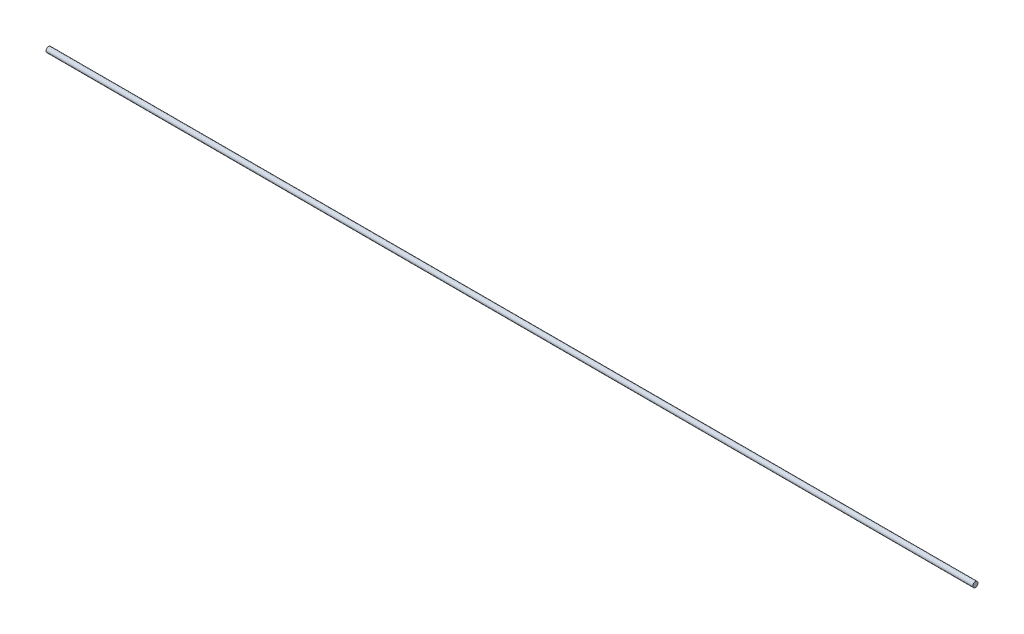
ISO-10303-21;
HEADER;
FILE_DESCRIPTION(('STEP AP214'),'2;1');
FILE_NAME('part.step','',(''),(''),'','','');
FILE_SCHEMA(('AUTOMOTIVE_DESIGN { 1 0 10303 214 1 1 1 1 }'));
ENDSEC;
DATA;
#1=APPLICATION_CONTEXT('core data for automotive mechanical design processes');
#2=APPLICATION_PROTOCOL_DEFINITION('international standard','automotive_design',2000,#1);
#3=PRODUCT_CONTEXT('',#1,'mechanical');
#4=PRODUCT('Part','Part','',(#3));
#5=PRODUCT_RELATED_PRODUCT_CATEGORY('part','',(#4));
#6=PRODUCT_DEFINITION_FORMATION('','',#4);
#7=PRODUCT_DEFINITION_CONTEXT('part definition',#1,'design');
#8=PRODUCT_DEFINITION('design','',#6,#7);
#9=PRODUCT_DEFINITION_SHAPE('','',#8);
#10=(LENGTH_UNIT() NAMED_UNIT(*) SI_UNIT(.MILLI.,.METRE.));
#11=(NAMED_UNIT(*) PLANE_ANGLE_UNIT() SI_UNIT($,.RADIAN.));
#12=(NAMED_UNIT(*) SI_UNIT($,.STERADIAN.) SOLID_ANGLE_UNIT());
#13=UNCERTAINTY_MEASURE_WITH_UNIT(LENGTH_MEASURE(1.E-05),#10,'distance_accuracy_value','');
#14=(GEOMETRIC_REPRESENTATION_CONTEXT(3) GLOBAL_UNCERTAINTY_ASSIGNED_CONTEXT((#13)) GLOBAL_UNIT_ASSIGNED_CONTEXT((#10,
#11,#12)) REPRESENTATION_CONTEXT('',''));
#15=CARTESIAN_POINT('',(0.,0.,0.));
#16=DIRECTION('',(0.,0.,1.));
#17=DIRECTION('',(1.,0.,0.));
#18=AXIS2_PLACEMENT_3D('',#15,#16,#17);
#19=CARTESIAN_POINT('',(1076.,0.,0.));
#20=DIRECTION('',(-1.,0.,0.));
#21=DIRECTION('',(0.,0.,1.));
#22=AXIS2_PLACEMENT_3D('',#19,#20,#21);
#23=CYLINDRICAL_SURFACE('',#22,3.);
#24=CARTESIAN_POINT('',(1076.,0.,0.));
#25=DIRECTION('',(1.,0.,0.));
#26=DIRECTION('',(0.,0.,-1.));
#27=AXIS2_PLACEMENT_3D('',#24,#25,#26);
#28=CIRCLE('',#27,3.);
#29=CARTESIAN_POINT('',(1076.,0.,-3.));
#30=VERTEX_POINT('',#29);
#31=EDGE_CURVE('E10',#30,#30,#28,.T.);
#32=ORIENTED_EDGE('',*,*,#31,.F.);
#33=EDGE_LOOP('',(#32));
#34=FACE_BOUND('',#33,.T.);
#35=CARTESIAN_POINT('',(0.,0.,0.));
#36=DIRECTION('',(1.,0.,0.));
#37=DIRECTION('',(0.,0.,-1.));
#38=AXIS2_PLACEMENT_3D('',#35,#36,#37);
#39=CIRCLE('',#38,3.);
#40=CARTESIAN_POINT('',(0.,0.,-3.));
#41=VERTEX_POINT('',#40);
#42=EDGE_CURVE('E33',#41,#41,#39,.T.);
#43=ORIENTED_EDGE('',*,*,#42,.T.);
#44=EDGE_LOOP('',(#43));
#45=FACE_BOUND('',#44,.T.);
#46=ADVANCED_FACE('F30',(#34,#45),#23,.T.);
#47=CARTESIAN_POINT('',(1076.,0.,0.));
#48=DIRECTION('',(1.,0.,0.));
#49=DIRECTION('',(0.,0.,-1.));
#50=AXIS2_PLACEMENT_3D('',#47,#48,#49);
#51=PLANE('',#50);
#52=ORIENTED_EDGE('',*,*,#31,.T.);
#53=EDGE_LOOP('',(#52));
#54=FACE_BOUND('',#53,.T.);
#55=ADVANCED_FACE('F45',(#54),#51,.T.);
#56=CARTESIAN_POINT('',(0.,0.,0.));
#57=DIRECTION('',(1.,0.,0.));
#58=DIRECTION('',(0.,0.,-1.));
#59=AXIS2_PLACEMENT_3D('',#56,#57,#58);
#60=PLANE('',#59);
#61=ORIENTED_EDGE('',*,*,#42,.F.);
#62=EDGE_LOOP('',(#61));
#63=FACE_BOUND('',#62,.T.);
#64=ADVANCED_FACE('F43',(#63),#60,.F.);
#65=CLOSED_SHELL('',(#46,#55,#64));
#66=MANIFOLD_SOLID_BREP('B2',#65);
#67=ADVANCED_BREP_SHAPE_REPRESENTATION('',(#18,#66),#14);
#68=SHAPE_DEFINITION_REPRESENTATION(#9,#67);
ENDSEC;
END-ISO-10303-21;
